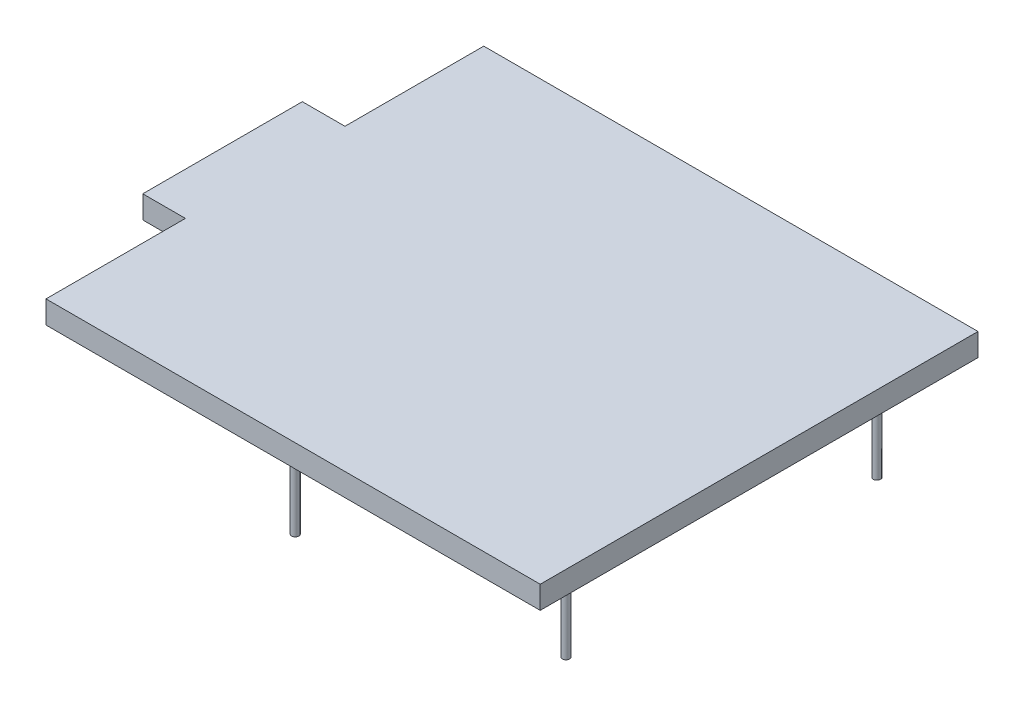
from build123d import *

# Parameters (mm, degrees)
BOSS_EXTRUDE1_DEPTH = 10
SKETCH2_R           = 1.6
BOSS_EXTRUDE2_DEPTH = 40


with BuildPart() as part:
    # Sketch1 → Boss-Extrude1 (new body)
    with BuildSketch(Plane(origin=(0, 0, 0), x_dir=(1, 0, 0), z_dir=(0, 1, 0))):
        Polygon((196.990512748, 28.023652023), (414.922512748, 28.023652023), (414.922512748, -165.016347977), (196.990512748, -165.016347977), (196.990512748, -103.548347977), (178.194512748, -103.548347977), (178.194512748, -33.190347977), (196.990512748, -33.190347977), align=None)
    extrude(amount=BOSS_EXTRUDE1_DEPTH)

    # Sketch2 → Boss-Extrude2 (add)
    with BuildSketch(Plane.XZ):
        with Locations(Location((291.700512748, 149.842465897, 0), (0, 0, 90))):
            Circle(SKETCH2_R)
        with Locations(Location((398.380512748, 137.085232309, 0), (0, 0, 90))):
            Circle(SKETCH2_R)
        with Locations(Location((398.306929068, -0.074747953, 0), (0, 0, 90))):
            Circle(SKETCH2_R)
        with Locations(Location((291.61330246, -12.71751071, 0), (0, 0, 90))):
            Circle(SKETCH2_R)
    extrude(amount=BOSS_EXTRUDE2_DEPTH)


solid = part.part
